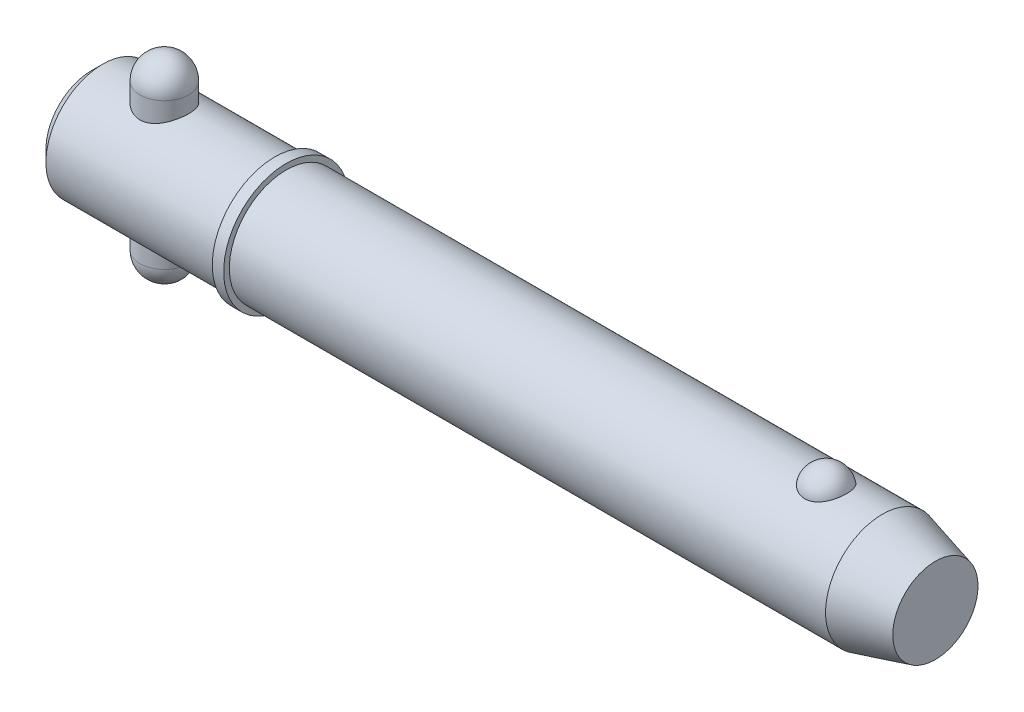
ISO-10303-21;
HEADER;
FILE_DESCRIPTION(('STEP AP214'),'2;1');
FILE_NAME('part.step','',(''),(''),'','','');
FILE_SCHEMA(('AUTOMOTIVE_DESIGN { 1 0 10303 214 1 1 1 1 }'));
ENDSEC;
DATA;
#1=APPLICATION_CONTEXT('core data for automotive mechanical design processes');
#2=APPLICATION_PROTOCOL_DEFINITION('international standard','automotive_design',2000,#1);
#3=PRODUCT_CONTEXT('',#1,'mechanical');
#4=PRODUCT('Part','Part','',(#3));
#5=PRODUCT_RELATED_PRODUCT_CATEGORY('part','',(#4));
#6=PRODUCT_DEFINITION_FORMATION('','',#4);
#7=PRODUCT_DEFINITION_CONTEXT('part definition',#1,'design');
#8=PRODUCT_DEFINITION('design','',#6,#7);
#9=PRODUCT_DEFINITION_SHAPE('','',#8);
#10=(LENGTH_UNIT() NAMED_UNIT(*) SI_UNIT(.MILLI.,.METRE.));
#11=(NAMED_UNIT(*) PLANE_ANGLE_UNIT() SI_UNIT($,.RADIAN.));
#12=(NAMED_UNIT(*) SI_UNIT($,.STERADIAN.) SOLID_ANGLE_UNIT());
#13=UNCERTAINTY_MEASURE_WITH_UNIT(LENGTH_MEASURE(1.E-05),#10,'distance_accuracy_value','');
#14=(GEOMETRIC_REPRESENTATION_CONTEXT(3) GLOBAL_UNCERTAINTY_ASSIGNED_CONTEXT((#13)) GLOBAL_UNIT_ASSIGNED_CONTEXT((#10,
#11,#12)) REPRESENTATION_CONTEXT('',''));
#15=CARTESIAN_POINT('',(0.,0.,0.));
#16=DIRECTION('',(0.,0.,1.));
#17=DIRECTION('',(1.,0.,0.));
#18=AXIS2_PLACEMENT_3D('',#15,#16,#17);
#19=CARTESIAN_POINT('',(14.28,19.05,0.));
#20=DIRECTION('',(0.,-1.,0.));
#21=DIRECTION('',(0.,0.,-1.));
#22=AXIS2_PLACEMENT_3D('',#19,#20,#21);
#23=CYLINDRICAL_SURFACE('',#22,4.76);
#24=CARTESIAN_POINT('',(14.28,-14.29,0.));
#25=DIRECTION('',(0.,-1.,0.));
#26=DIRECTION('',(0.,0.,-1.));
#27=AXIS2_PLACEMENT_3D('',#24,#25,#26);
#28=CIRCLE('',#27,4.76);
#29=CARTESIAN_POINT('',(14.28,-14.29,-4.76));
#30=VERTEX_POINT('',#29);
#31=EDGE_CURVE('P0_E10',#30,#30,#28,.F.);
#32=CARTESIAN_POINT('',(14.28,14.29,0.));
#33=DIRECTION('',(0.,-1.,0.));
#34=DIRECTION('',(0.,0.,-1.));
#35=AXIS2_PLACEMENT_3D('',#32,#33,#34);
#36=CIRCLE('',#35,4.76);
#37=CARTESIAN_POINT('',(14.28,14.29,-4.76));
#38=VERTEX_POINT('',#37);
#39=EDGE_CURVE('P0_E21',#38,#38,#36,.T.);
#40=CARTESIAN_POINT('',(14.28,-14.29,-4.76));
#41=CARTESIAN_POINT('',(14.28,-13.9922916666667,-4.76));
#42=CARTESIAN_POINT('',(14.28,-13.6945833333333,-4.76));
#43=CARTESIAN_POINT('',(14.28,-13.0991666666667,-4.76));
#44=CARTESIAN_POINT('',(14.28,-12.8014583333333,-4.76));
#45=CARTESIAN_POINT('',(14.28,-12.2060416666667,-4.76));
#46=CARTESIAN_POINT('',(14.28,-11.9083333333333,-4.76));
#47=CARTESIAN_POINT('',(14.28,-11.3129166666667,-4.76));
#48=CARTESIAN_POINT('',(14.28,-11.0152083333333,-4.76));
#49=CARTESIAN_POINT('',(14.28,-10.4197916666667,-4.76));
#50=CARTESIAN_POINT('',(14.28,-10.1220833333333,-4.76));
#51=CARTESIAN_POINT('',(14.28,-9.52666666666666,-4.76));
#52=CARTESIAN_POINT('',(14.28,-9.22895833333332,-4.76));
#53=CARTESIAN_POINT('',(14.28,-8.63354166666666,-4.76));
#54=CARTESIAN_POINT('',(14.28,-8.33583333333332,-4.76));
#55=CARTESIAN_POINT('',(14.28,-7.74041666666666,-4.76));
#56=CARTESIAN_POINT('',(14.28,-7.44270833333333,-4.76));
#57=CARTESIAN_POINT('',(14.28,-6.84729166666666,-4.76));
#58=CARTESIAN_POINT('',(14.28,-6.54958333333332,-4.76));
#59=CARTESIAN_POINT('',(14.28,-5.95416666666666,-4.76));
#60=CARTESIAN_POINT('',(14.28,-5.65645833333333,-4.76));
#61=CARTESIAN_POINT('',(14.28,-5.06104166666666,-4.76));
#62=CARTESIAN_POINT('',(14.28,-4.76333333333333,-4.76));
#63=CARTESIAN_POINT('',(14.28,-4.16791666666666,-4.76));
#64=CARTESIAN_POINT('',(14.28,-3.87020833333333,-4.76));
#65=CARTESIAN_POINT('',(14.28,-3.27479166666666,-4.76));
#66=CARTESIAN_POINT('',(14.28,-2.97708333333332,-4.76));
#67=CARTESIAN_POINT('',(14.28,-2.38166666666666,-4.76));
#68=CARTESIAN_POINT('',(14.28,-2.08395833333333,-4.76));
#69=CARTESIAN_POINT('',(14.28,-1.48854166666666,-4.76));
#70=CARTESIAN_POINT('',(14.28,-1.19083333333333,-4.76));
#71=CARTESIAN_POINT('',(14.28,-0.595416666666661,-4.76));
#72=CARTESIAN_POINT('',(14.28,-0.297708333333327,-4.76));
#73=CARTESIAN_POINT('',(14.28,0.297708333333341,-4.76));
#74=CARTESIAN_POINT('',(14.28,0.595416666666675,-4.76));
#75=CARTESIAN_POINT('',(14.28,1.19083333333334,-4.76));
#76=CARTESIAN_POINT('',(14.28,1.48854166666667,-4.76));
#77=CARTESIAN_POINT('',(14.28,2.08395833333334,-4.76));
#78=CARTESIAN_POINT('',(14.28,2.38166666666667,-4.76));
#79=CARTESIAN_POINT('',(14.28,2.97708333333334,-4.76));
#80=CARTESIAN_POINT('',(14.28,3.27479166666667,-4.76));
#81=CARTESIAN_POINT('',(14.28,3.87020833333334,-4.76));
#82=CARTESIAN_POINT('',(14.28,4.16791666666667,-4.76));
#83=CARTESIAN_POINT('',(14.28,4.76333333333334,-4.76));
#84=CARTESIAN_POINT('',(14.28,5.06104166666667,-4.76));
#85=CARTESIAN_POINT('',(14.28,5.65645833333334,-4.76));
#86=CARTESIAN_POINT('',(14.28,5.95416666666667,-4.76));
#87=CARTESIAN_POINT('',(14.28,6.54958333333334,-4.76));
#88=CARTESIAN_POINT('',(14.28,6.84729166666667,-4.76));
#89=CARTESIAN_POINT('',(14.28,7.44270833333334,-4.76));
#90=CARTESIAN_POINT('',(14.28,7.74041666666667,-4.76));
#91=CARTESIAN_POINT('',(14.28,8.33583333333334,-4.76));
#92=CARTESIAN_POINT('',(14.28,8.63354166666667,-4.76));
#93=CARTESIAN_POINT('',(14.28,9.22895833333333,-4.76));
#94=CARTESIAN_POINT('',(14.28,9.52666666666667,-4.76));
#95=CARTESIAN_POINT('',(14.28,10.1220833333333,-4.76));
#96=CARTESIAN_POINT('',(14.28,10.4197916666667,-4.76));
#97=CARTESIAN_POINT('',(14.28,11.0152083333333,-4.76));
#98=CARTESIAN_POINT('',(14.28,11.3129166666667,-4.76));
#99=CARTESIAN_POINT('',(14.28,11.9083333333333,-4.76));
#100=CARTESIAN_POINT('',(14.28,12.2060416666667,-4.76));
#101=CARTESIAN_POINT('',(14.28,12.8014583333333,-4.76));
#102=CARTESIAN_POINT('',(14.28,13.0991666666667,-4.76));
#103=CARTESIAN_POINT('',(14.28,13.6945833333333,-4.76));
#104=CARTESIAN_POINT('',(14.28,13.9922916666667,-4.76));
#105=CARTESIAN_POINT('',(14.28,14.29,-4.76));
#106=B_SPLINE_CURVE_WITH_KNOTS('',3,(#40,#41,#42,#43,#44,#45,#46,#47,#48,#49,#50,#51,#52,#53,
#54,#55,#56,#57,#58,#59,#60,#61,#62,#63,#64,#65,#66,#67,#68,#69,#70,#71,#72,#73,#74,#75,#76,#77,
#78,#79,#80,#81,#82,#83,#84,#85,#86,#87,#88,#89,#90,#91,#92,#93,#94,#95,#96,#97,#98,#99,#100,
#101,#102,#103,#104,#105),.UNSPECIFIED.,.F.,.F.,(4,2,2,2,2,2,2,2,2,2,2,2,2,2,2,2,2,2,2,2,2,2,2,
2,2,2,2,2,2,2,2,2,4),(0.,0.893125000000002,1.78625,2.67937499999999,3.5725,4.465625,5.35875,
6.25187499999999,7.145,8.038125,8.93125,9.82437499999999,10.7175,11.610625,12.50375,13.396875,
14.29,15.183125,16.07625,16.969375,17.8625,18.755625,19.64875,20.541875,21.435,22.328125,
23.22125,24.114375,25.0075,25.900625,26.79375,27.686875,28.58),.UNSPECIFIED.);
#107=EDGE_CURVE('P0_BSEAM14',#30,#38,#106,.T.);
#108=ORIENTED_EDGE('',*,*,#31,.T.);
#109=ORIENTED_EDGE('',*,*,#39,.T.);
#110=ORIENTED_EDGE('',*,*,#107,.T.);
#111=ORIENTED_EDGE('',*,*,#107,.F.);
#112=EDGE_LOOP('',(#108,#110,#109,#111));
#113=FACE_BOUND('',#112,.T.);
#114=ADVANCED_FACE('P0_F14',(#113),#23,.T.);
#115=CARTESIAN_POINT('',(14.28,-14.29,0.));
#116=DIRECTION('',(0.,0.,1.));
#117=DIRECTION('',(1.,0.,0.));
#118=AXIS2_PLACEMENT_3D('',#115,#116,#117);
#119=SPHERICAL_SURFACE('',#118,4.76);
#120=CARTESIAN_POINT('',(14.28,-14.29,0.));
#121=DIRECTION('',(0.,-1.,0.));
#122=DIRECTION('',(0.,0.,-1.));
#123=AXIS2_PLACEMENT_3D('',#120,#121,#122);
#124=SPHERICAL_SURFACE('',#123,4.76);
#125=ORIENTED_EDGE('',*,*,#31,.F.);
#126=EDGE_LOOP('',(#125));
#127=FACE_BOUND('',#126,.T.);
#128=ADVANCED_FACE('P0_F29',(#127),#124,.T.);
#129=CARTESIAN_POINT('',(14.28,14.29,0.));
#130=DIRECTION('',(0.,0.,1.));
#131=DIRECTION('',(1.,0.,0.));
#132=AXIS2_PLACEMENT_3D('',#129,#130,#131);
#133=SPHERICAL_SURFACE('',#132,4.76);
#134=CARTESIAN_POINT('',(14.28,14.29,0.));
#135=DIRECTION('',(0.,-1.,0.));
#136=DIRECTION('',(0.,0.,-1.));
#137=AXIS2_PLACEMENT_3D('',#134,#135,#136);
#138=SPHERICAL_SURFACE('',#137,4.76);
#139=ORIENTED_EDGE('',*,*,#39,.F.);
#140=EDGE_LOOP('',(#139));
#141=FACE_BOUND('',#140,.T.);
#142=ADVANCED_FACE('P0_F16',(#141),#138,.T.);
#143=CLOSED_SHELL('',(#114,#128,#142));
#144=MANIFOLD_SOLID_BREP('P0_B1',#143);
#145=CARTESIAN_POINT('',(0.,0.,0.));
#146=DIRECTION('',(1.,0.,0.));
#147=DIRECTION('',(0.,0.,-1.));
#148=AXIS2_PLACEMENT_3D('',#145,#146,#147);
#149=CYLINDRICAL_SURFACE('',#148,11.115);
#150=CARTESIAN_POINT('',(154.729563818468,0.,0.));
#151=DIRECTION('',(1.,0.,0.));
#152=DIRECTION('',(0.,0.,-1.));
#153=AXIS2_PLACEMENT_3D('',#150,#151,#152);
#154=CIRCLE('',#153,11.115);
#155=CARTESIAN_POINT('',(154.729563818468,0.,-11.115));
#156=VERTEX_POINT('',#155);
#157=EDGE_CURVE('P1_E81',#156,#156,#154,.T.);
#158=ORIENTED_EDGE('',*,*,#157,.F.);
#159=EDGE_LOOP('',(#158));
#160=FACE_BOUND('',#159,.T.);
#161=CARTESIAN_POINT('',(38.1,0.,0.));
#162=DIRECTION('',(1.,0.,0.));
#163=DIRECTION('',(0.,0.,-1.));
#164=AXIS2_PLACEMENT_3D('',#161,#162,#163);
#165=CIRCLE('',#164,11.115);
#166=CARTESIAN_POINT('',(38.1,0.,-11.115));
#167=VERTEX_POINT('',#166);
#168=EDGE_CURVE('P1_E85',#167,#167,#165,.T.);
#169=ORIENTED_EDGE('',*,*,#168,.T.);
#170=EDGE_LOOP('',(#169));
#171=FACE_BOUND('',#170,.T.);
#172=CARTESIAN_POINT('',(143.731068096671,10.3028087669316,4.17077409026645));
#173=CARTESIAN_POINT('',(143.514775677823,10.3028003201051,4.17078240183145));
#174=CARTESIAN_POINT('',(143.298548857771,10.3098895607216,4.15340593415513));
#175=CARTESIAN_POINT('',(142.872540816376,10.3373834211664,4.08449540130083));
#176=CARTESIAN_POINT('',(142.662757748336,10.3577841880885,4.0329712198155));
#177=CARTESIAN_POINT('',(142.255782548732,10.4095237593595,3.89746513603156));
#178=CARTESIAN_POINT('',(142.058572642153,10.4408466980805,3.81353029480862));
#179=CARTESIAN_POINT('',(141.681338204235,10.5110236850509,3.61560339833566));
#180=CARTESIAN_POINT('',(141.501317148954,10.5498792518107,3.50160528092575));
#181=CARTESIAN_POINT('',(141.157684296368,10.6322884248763,3.24292464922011));
#182=CARTESIAN_POINT('',(140.994686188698,10.6759443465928,3.09746040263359));
#183=CARTESIAN_POINT('',(140.694591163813,10.7625291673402,2.7817192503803));
#184=CARTESIAN_POINT('',(140.557499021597,10.8054579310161,2.61143778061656));
#185=CARTESIAN_POINT('',(140.306408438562,10.8881935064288,2.24226695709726));
#186=CARTESIAN_POINT('',(140.193710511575,10.9277761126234,2.04244123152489));
#187=CARTESIAN_POINT('',(140.001777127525,10.997484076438,1.62578254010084));
#188=CARTESIAN_POINT('',(139.922544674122,11.0276085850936,1.40894804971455));
#189=CARTESIAN_POINT('',(139.798303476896,11.0756732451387,0.961250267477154));
#190=CARTESIAN_POINT('',(139.753760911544,11.0934470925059,0.730239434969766));
#191=CARTESIAN_POINT('',(139.701569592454,11.1143331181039,0.263439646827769));
#192=CARTESIAN_POINT('',(139.693920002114,11.1174456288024,0.027650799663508));
#193=CARTESIAN_POINT('',(139.71561056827,11.1087161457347,-0.440729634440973));
#194=CARTESIAN_POINT('',(139.744762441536,11.0969502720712,-0.6733313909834));
#195=CARTESIAN_POINT('',(139.839143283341,11.0597872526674,-1.12996621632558));
#196=CARTESIAN_POINT('',(139.904372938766,11.0343898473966,-1.35399912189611));
#197=CARTESIAN_POINT('',(140.06969844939,10.972515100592,-1.78750286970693));
#198=CARTESIAN_POINT('',(140.16983863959,10.9360236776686,-1.99695478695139));
#199=CARTESIAN_POINT('',(140.402940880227,10.8557595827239,-2.3952066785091));
#200=CARTESIAN_POINT('',(140.535905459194,10.8119863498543,-2.5840050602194));
#201=CARTESIAN_POINT('',(140.832407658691,10.7216733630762,-2.93635726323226));
#202=CARTESIAN_POINT('',(140.996056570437,10.675123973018,-3.09981510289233));
#203=CARTESIAN_POINT('',(141.349860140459,10.5846571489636,-3.39592247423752));
#204=CARTESIAN_POINT('',(141.540012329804,10.5407394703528,-3.52857487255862));
#205=CARTESIAN_POINT('',(141.93750141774,10.4616690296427,-3.75646057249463));
#206=CARTESIAN_POINT('',(142.14436705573,10.4263443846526,-3.85245432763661));
#207=CARTESIAN_POINT('',(142.572954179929,10.3675574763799,-4.00798747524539));
#208=CARTESIAN_POINT('',(142.794670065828,10.344090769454,-4.0675405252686));
#209=CARTESIAN_POINT('',(143.234669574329,10.3128282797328,-4.14614314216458));
#210=CARTESIAN_POINT('',(143.452565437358,10.3043040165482,-4.1670783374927));
#211=CARTESIAN_POINT('',(143.88894951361,10.3016771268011,-4.17357158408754));
#212=CARTESIAN_POINT('',(144.107437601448,10.3075716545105,-4.15913661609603));
#213=CARTESIAN_POINT('',(144.531744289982,10.3326686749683,-4.09636961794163));
#214=CARTESIAN_POINT('',(144.737745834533,10.3514555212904,-4.0490957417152));
#215=CARTESIAN_POINT('',(145.138576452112,10.399818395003,-3.92320197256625));
#216=CARTESIAN_POINT('',(145.3334046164,10.4293952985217,-3.84457953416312));
#217=CARTESIAN_POINT('',(145.711191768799,10.4969600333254,-3.65612410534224));
#218=CARTESIAN_POINT('',(145.893797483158,10.5351178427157,-3.54564545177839));
#219=CARTESIAN_POINT('',(146.238204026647,10.6154999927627,-3.29718036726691));
#220=CARTESIAN_POINT('',(146.400000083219,10.657725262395,-3.15918764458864));
#221=CARTESIAN_POINT('',(146.706959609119,10.744212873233,-2.85163580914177));
#222=CARTESIAN_POINT('',(146.850891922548,10.7884718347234,-2.68084605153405));
#223=CARTESIAN_POINT('',(147.109237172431,10.872374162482,-2.31721864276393));
#224=CARTESIAN_POINT('',(147.223644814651,10.9120167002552,-2.12437704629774));
#225=CARTESIAN_POINT('',(147.423873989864,10.9838919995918,-1.71516999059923));
#226=CARTESIAN_POINT('',(147.50866178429,11.0158465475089,-1.49824866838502));
#227=CARTESIAN_POINT('',(147.64268382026,11.0673523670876,-1.05228572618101));
#228=CARTESIAN_POINT('',(147.691917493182,11.086903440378,-0.823243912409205));
#229=CARTESIAN_POINT('',(147.753891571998,11.1116323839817,-0.359087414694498));
#230=CARTESIAN_POINT('',(147.766566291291,11.1167843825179,-0.12396256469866));
#231=CARTESIAN_POINT('',(147.754973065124,11.1121144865,0.345220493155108));
#232=CARTESIAN_POINT('',(147.730705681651,11.1022928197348,0.579278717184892));
#233=CARTESIAN_POINT('',(147.645907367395,11.0687504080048,1.03866534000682));
#234=CARTESIAN_POINT('',(147.585529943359,11.0450885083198,1.26402641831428));
#235=CARTESIAN_POINT('',(147.429853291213,10.9863185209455,1.70076772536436));
#236=CARTESIAN_POINT('',(147.334551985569,10.9512097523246,1.91214712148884));
#237=CARTESIAN_POINT('',(147.110397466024,10.8729733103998,2.316083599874));
#238=CARTESIAN_POINT('',(146.981380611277,10.8298068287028,2.50854240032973));
#239=CARTESIAN_POINT('',(146.692732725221,10.7401896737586,2.86808766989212));
#240=CARTESIAN_POINT('',(146.533102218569,10.6937390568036,3.03517457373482));
#241=CARTESIAN_POINT('',(146.187534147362,10.6029321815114,3.33857581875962));
#242=CARTESIAN_POINT('',(146.001708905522,10.5585680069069,3.47501541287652));
#243=CARTESIAN_POINT('',(145.607875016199,10.4769321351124,3.71390897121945));
#244=CARTESIAN_POINT('',(145.399863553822,10.439661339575,3.81635861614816));
#245=CARTESIAN_POINT('',(144.954066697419,10.3749407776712,3.98910631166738));
#246=CARTESIAN_POINT('',(144.715234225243,10.3482457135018,4.05700929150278));
#247=CARTESIAN_POINT('',(144.227925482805,10.312188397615,4.14782844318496));
#248=CARTESIAN_POINT('',(143.979453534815,10.3028184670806,4.17076454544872));
#249=CARTESIAN_POINT('',(143.731068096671,10.3028087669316,4.17077409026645));
#250=B_SPLINE_CURVE_WITH_KNOTS('',3,(#172,#173,#174,#175,#176,#177,#178,#179,#180,#181,#182,
#183,#184,#185,#186,#187,#188,#189,#190,#191,#192,#193,#194,#195,#196,#197,#198,#199,#200,#201,
#202,#203,#204,#205,#206,#207,#208,#209,#210,#211,#212,#213,#214,#215,#216,#217,#218,#219,#220,
#221,#222,#223,#224,#225,#226,#227,#228,#229,#230,#231,#232,#233,#234,#235,#236,#237,#238,#239,
#240,#241,#242,#243,#244,#245,#246,#247,#248,#249),.UNSPECIFIED.,.T.,.F.,(4,2,2,2,2,2,2,2,2,2,2,
2,2,2,2,2,2,2,2,2,2,2,2,2,2,2,2,2,2,2,2,2,2,2,2,2,2,2,4),(0.,0.64796614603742,1.29574482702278,
1.9425864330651,2.58955857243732,3.25496465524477,3.92049326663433,4.61566368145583,
5.31089647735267,6.01531821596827,6.71972398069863,7.42054043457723,8.12137023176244,
8.82309331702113,9.5248704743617,10.2292439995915,10.9335519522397,11.6223330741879,
12.3108558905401,12.9647664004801,13.6185478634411,14.252184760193,14.8858731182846,
15.5334360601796,16.1811472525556,16.8611459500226,17.5412664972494,18.2431855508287,
18.9451158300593,19.6483065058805,20.3514864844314,21.0516982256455,21.7519516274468,
22.4556690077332,23.1593743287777,23.860149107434,24.5610129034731,25.3054529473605,
26.049562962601),.UNSPECIFIED.);
#251=CARTESIAN_POINT('',(143.731068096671,10.3028087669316,4.17077409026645));
#252=VERTEX_POINT('',#251);
#253=EDGE_CURVE('P1_E35',#252,#252,#250,.T.);
#254=ORIENTED_EDGE('',*,*,#253,.T.);
#255=EDGE_LOOP('',(#254));
#256=FACE_BOUND('',#255,.T.);
#257=ADVANCED_FACE('P1_F13',(#160,#171,#256),#149,.T.);
#258=CARTESIAN_POINT('',(0.,0.,0.));
#259=DIRECTION('',(-1.,0.,0.));
#260=DIRECTION('',(0.,0.,1.));
#261=AXIS2_PLACEMENT_3D('',#258,#259,#260);
#262=PLANE('',#261);
#263=CARTESIAN_POINT('',(0.,0.,0.));
#264=DIRECTION('',(1.,0.,0.));
#265=DIRECTION('',(0.,0.,-1.));
#266=AXIS2_PLACEMENT_3D('',#263,#264,#265);
#267=CIRCLE('',#266,8.892);
#268=CARTESIAN_POINT('',(0.,0.,-8.892));
#269=VERTEX_POINT('',#268);
#270=EDGE_CURVE('P1_E9',#269,#269,#267,.T.);
#271=ORIENTED_EDGE('',*,*,#270,.F.);
#272=EDGE_LOOP('',(#271));
#273=FACE_BOUND('',#272,.T.);
#274=ADVANCED_FACE('P1_F15',(#273),#262,.T.);
#275=CARTESIAN_POINT('',(2.22299999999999,0.,0.));
#276=DIRECTION('',(1.,0.,0.));
#277=DIRECTION('',(0.,0.,-1.));
#278=AXIS2_PLACEMENT_3D('',#275,#276,#277);
#279=CONICAL_SURFACE('',#278,11.115,0.78539816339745);
#280=ORIENTED_EDGE('',*,*,#270,.T.);
#281=EDGE_LOOP('',(#280));
#282=FACE_BOUND('',#281,.T.);
#283=CARTESIAN_POINT('',(2.22299999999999,0.,0.));
#284=DIRECTION('',(1.,0.,0.));
#285=DIRECTION('',(0.,0.,-1.));
#286=AXIS2_PLACEMENT_3D('',#283,#284,#285);
#287=CIRCLE('',#286,11.115);
#288=CARTESIAN_POINT('',(2.22299999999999,0.,-11.115));
#289=VERTEX_POINT('',#288);
#290=EDGE_CURVE('P1_E26',#289,#289,#287,.T.);
#291=ORIENTED_EDGE('',*,*,#290,.F.);
#292=EDGE_LOOP('',(#291));
#293=FACE_BOUND('',#292,.T.);
#294=ADVANCED_FACE('P1_F77',(#282,#293),#279,.T.);
#295=CARTESIAN_POINT('',(0.,0.,0.));
#296=DIRECTION('',(1.,0.,0.));
#297=DIRECTION('',(0.,0.,-1.));
#298=AXIS2_PLACEMENT_3D('',#295,#296,#297);
#299=CYLINDRICAL_SURFACE('',#298,11.115);
#300=CARTESIAN_POINT('',(14.28,-10.0441836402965,4.76));
#301=CARTESIAN_POINT('',(14.1533731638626,-10.0441846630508,4.75999904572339));
#302=CARTESIAN_POINT('',(14.0267055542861,-10.0465865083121,4.75493985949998));
#303=CARTESIAN_POINT('',(13.774298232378,-10.0561141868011,4.73475585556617));
#304=CARTESIAN_POINT('',(13.6485591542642,-10.0632429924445,4.71962470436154));
#305=CARTESIAN_POINT('',(13.3987500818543,-10.0819979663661,4.67942666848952));
#306=CARTESIAN_POINT('',(13.2746840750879,-10.0936334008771,4.65433930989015));
#307=CARTESIAN_POINT('',(13.0293244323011,-10.1210146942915,4.59449317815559));
#308=CARTESIAN_POINT('',(12.9080319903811,-10.1367622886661,4.55973032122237));
#309=CARTESIAN_POINT('',(12.669614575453,-10.1717810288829,4.48106435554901));
#310=CARTESIAN_POINT('',(12.5524727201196,-10.1910352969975,4.4372048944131));
#311=CARTESIAN_POINT('',(12.3224300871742,-10.2325403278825,4.34063417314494));
#312=CARTESIAN_POINT('',(12.2095309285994,-10.2547922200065,4.28791957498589));
#313=CARTESIAN_POINT('',(11.8782785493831,-10.3250879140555,4.11715127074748));
#314=CARTESIAN_POINT('',(11.6670799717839,-10.3767168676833,3.98637638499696));
#315=CARTESIAN_POINT('',(11.2564039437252,-10.4874309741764,3.68567149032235));
#316=CARTESIAN_POINT('',(11.0583793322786,-10.5467772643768,3.51386978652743));
#317=CARTESIAN_POINT('',(10.6927724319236,-10.6641377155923,3.13969960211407));
#318=CARTESIAN_POINT('',(10.5252022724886,-10.7221513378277,2.93731900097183));
#319=CARTESIAN_POINT('',(10.2965609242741,-10.8050020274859,2.60935726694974));
#320=CARTESIAN_POINT('',(10.2227768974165,-10.8324811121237,2.49310321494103));
#321=CARTESIAN_POINT('',(10.0853380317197,-10.884703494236,2.25418999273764));
#322=CARTESIAN_POINT('',(10.0216789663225,-10.9094479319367,2.13153352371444));
#323=CARTESIAN_POINT('',(9.90506238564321,-10.9554932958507,1.88060370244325));
#324=CARTESIAN_POINT('',(9.85210574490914,-10.9767939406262,1.7523298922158));
#325=CARTESIAN_POINT('',(9.75746464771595,-11.0153112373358,1.49115740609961));
#326=CARTESIAN_POINT('',(9.71577447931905,-11.0325299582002,1.35826111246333));
#327=CARTESIAN_POINT('',(9.64605475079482,-11.0615607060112,1.09614539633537));
#328=CARTESIAN_POINT('',(9.61740732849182,-11.0736151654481,0.96711700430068));
#329=CARTESIAN_POINT('',(9.57092026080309,-11.0932687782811,0.706847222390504));
#330=CARTESIAN_POINT('',(9.55307574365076,-11.1008699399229,0.575606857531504));
#331=CARTESIAN_POINT('',(9.52838640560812,-11.1114054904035,0.31192917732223));
#332=CARTESIAN_POINT('',(9.52153986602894,-11.114340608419,0.179492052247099));
#333=CARTESIAN_POINT('',(9.51892405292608,-11.1154607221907,-0.0855090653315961));
#334=CARTESIAN_POINT('',(9.52315432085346,-11.1136459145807,-0.218073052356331));
#335=CARTESIAN_POINT('',(9.542009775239,-11.1055891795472,-0.473709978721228));
#336=CARTESIAN_POINT('',(9.55594693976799,-11.099640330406,-0.596843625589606));
#337=CARTESIAN_POINT('',(9.59332832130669,-11.0837823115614,-0.841440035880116));
#338=CARTESIAN_POINT('',(9.61677567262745,-11.0738718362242,-0.962902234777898));
#339=CARTESIAN_POINT('',(9.67294089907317,-11.0503378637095,-1.20325684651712));
#340=CARTESIAN_POINT('',(9.70565569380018,-11.0367156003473,-1.32215009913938));
#341=CARTESIAN_POINT('',(9.78005008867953,-11.0060908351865,-1.55666640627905));
#342=CARTESIAN_POINT('',(9.82173311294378,-10.9890870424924,-1.67228819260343));
#343=CARTESIAN_POINT('',(9.96110379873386,-10.9330280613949,-2.01656166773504));
#344=CARTESIAN_POINT('',(10.0722987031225,-10.8892801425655,-2.23915547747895));
#345=CARTESIAN_POINT('',(10.3268588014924,-10.7934745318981,-2.66299199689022));
#346=CARTESIAN_POINT('',(10.4702355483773,-10.7414138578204,-2.86422700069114));
#347=CARTESIAN_POINT('',(10.7973904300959,-10.6296201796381,-3.25557775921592));
#348=CARTESIAN_POINT('',(10.9833705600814,-10.569604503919,-3.443774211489));
#349=CARTESIAN_POINT('',(11.3844486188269,-10.4514707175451,-3.78722133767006));
#350=CARTESIAN_POINT('',(11.5995590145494,-10.3933534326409,-3.94245783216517));
#351=CARTESIAN_POINT('',(11.9444340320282,-10.311516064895,-4.14990014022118));
#352=CARTESIAN_POINT('',(12.0654579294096,-10.2847012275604,-4.21573894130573));
#353=CARTESIAN_POINT('',(12.3132718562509,-10.2342051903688,-4.33688518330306));
#354=CARTESIAN_POINT('',(12.4400593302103,-10.2105226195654,-4.39219723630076));
#355=CARTESIAN_POINT('',(12.6985418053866,-10.1671237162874,-4.49174500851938));
#356=CARTESIAN_POINT('',(12.8302359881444,-10.1474067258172,-4.53598256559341));
#357=CARTESIAN_POINT('',(13.0975061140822,-10.1126841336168,-4.61287629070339));
#358=CARTESIAN_POINT('',(13.233079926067,-10.0976759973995,-4.64553869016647));
#359=CARTESIAN_POINT('',(13.4978553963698,-10.0737863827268,-4.6971059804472));
#360=CARTESIAN_POINT('',(13.6268754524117,-10.0645618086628,-4.716785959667));
#361=CARTESIAN_POINT('',(13.8862990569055,-10.051062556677,-4.74548419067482));
#362=CARTESIAN_POINT('',(14.0167019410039,-10.0467856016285,-4.75450734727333));
#363=CARTESIAN_POINT('',(14.277859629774,-10.0433352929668,-4.76179143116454));
#364=CARTESIAN_POINT('',(14.4086143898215,-10.0441613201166,-4.76005366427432));
#365=CARTESIAN_POINT('',(14.6694025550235,-10.0508838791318,-4.74584231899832));
#366=CARTESIAN_POINT('',(14.7994359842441,-10.0567802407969,-4.73336910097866));
#367=CARTESIAN_POINT('',(15.0487369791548,-10.0728449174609,-4.69907984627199));
#368=CARTESIAN_POINT('',(15.1681238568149,-10.0826872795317,-4.67797462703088));
#369=CARTESIAN_POINT('',(15.4045894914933,-10.1062580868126,-4.62682977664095));
#370=CARTESIAN_POINT('',(15.5216674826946,-10.1199877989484,-4.59678723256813));
#371=CARTESIAN_POINT('',(15.868278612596,-10.1664161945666,-4.49365911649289));
#372=CARTESIAN_POINT('',(16.0933756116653,-10.2043671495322,-4.40754694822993));
#373=CARTESIAN_POINT('',(16.5357981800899,-10.2919879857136,-4.19898201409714));
#374=CARTESIAN_POINT('',(16.7523611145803,-10.3420954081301,-4.07511281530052));
#375=CARTESIAN_POINT('',(17.1627188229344,-10.4477911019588,-3.7959429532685));
#376=CARTESIAN_POINT('',(17.3565033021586,-10.5033818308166,-3.64062816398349));
#377=CARTESIAN_POINT('',(17.7334034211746,-10.6196376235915,-3.28693729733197));
#378=CARTESIAN_POINT('',(17.9141276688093,-10.6803237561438,-3.08599175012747));
#379=CARTESIAN_POINT('',(18.1582189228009,-10.7666348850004,-2.76320365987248));
#380=CARTESIAN_POINT('',(18.2351223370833,-10.7946346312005,-2.65197124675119));
#381=CARTESIAN_POINT('',(18.3793967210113,-10.8483267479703,-2.42297927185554));
#382=CARTESIAN_POINT('',(18.4467718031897,-10.87402011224,-2.30522255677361));
#383=CARTESIAN_POINT('',(18.5717669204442,-10.9225249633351,-2.06324665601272));
#384=CARTESIAN_POINT('',(18.6293326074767,-10.9453202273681,-1.93899615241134));
#385=CARTESIAN_POINT('',(18.73370006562,-10.9872100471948,-1.6855059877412));
#386=CARTESIAN_POINT('',(18.7805065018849,-11.0063062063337,-1.55626851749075));
#387=CARTESIAN_POINT('',(18.8628731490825,-11.0402419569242,-1.29375150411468));
#388=CARTESIAN_POINT('',(18.8984366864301,-11.0550828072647,-1.16047316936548));
#389=CARTESIAN_POINT('',(18.9579183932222,-11.0800638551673,-0.890912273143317));
#390=CARTESIAN_POINT('',(18.9818374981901,-11.0902044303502,-0.75462995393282));
#391=CARTESIAN_POINT('',(19.0164177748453,-11.104911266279,-0.490295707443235));
#392=CARTESIAN_POINT('',(19.027922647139,-11.1098318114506,-0.362373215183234));
#393=CARTESIAN_POINT('',(19.040554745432,-11.1152360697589,-0.105876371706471));
#394=CARTESIAN_POINT('',(19.0416784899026,-11.1157182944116,0.0226981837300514));
#395=CARTESIAN_POINT('',(19.0335275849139,-11.1122291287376,0.27938352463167));
#396=CARTESIAN_POINT('',(19.0242587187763,-11.1082602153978,0.407494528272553));
#397=CARTESIAN_POINT('',(18.9954320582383,-11.0959792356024,0.662388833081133));
#398=CARTESIAN_POINT('',(18.9758704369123,-11.0876655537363,0.789171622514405));
#399=CARTESIAN_POINT('',(18.9276379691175,-11.0673259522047,1.03545890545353));
#400=CARTESIAN_POINT('',(18.8993573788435,-11.0554596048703,1.15505309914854));
#401=CARTESIAN_POINT('',(18.8337694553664,-11.0282166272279,1.39134516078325));
#402=CARTESIAN_POINT('',(18.7964589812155,-11.0128387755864,1.5080420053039));
#403=CARTESIAN_POINT('',(18.671464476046,-10.9619666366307,1.85262797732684));
#404=CARTESIAN_POINT('',(18.5706772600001,-10.9217161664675,2.07521484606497));
#405=CARTESIAN_POINT('',(18.33202463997,-10.8301378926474,2.51061719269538));
#406=CARTESIAN_POINT('',(18.1926775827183,-10.7783885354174,2.72252375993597));
#407=CARTESIAN_POINT('',(17.8829747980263,-10.669863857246,3.12088015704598));
#408=CARTESIAN_POINT('',(17.7126068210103,-10.6130865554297,3.30731987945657));
#409=CARTESIAN_POINT('',(17.3310036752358,-10.495668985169,3.66358491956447));
#410=CARTESIAN_POINT('',(17.1177010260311,-10.4350471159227,3.83122543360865));
#411=CARTESIAN_POINT('',(16.7778915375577,-10.3495418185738,4.05420569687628));
#412=CARTESIAN_POINT('',(16.6612023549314,-10.3219229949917,4.12383380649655));
#413=CARTESIAN_POINT('',(16.4218466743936,-10.2693487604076,4.25306463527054));
#414=CARTESIAN_POINT('',(16.2991829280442,-10.2443921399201,4.31267191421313));
#415=CARTESIAN_POINT('',(16.0488008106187,-10.1979981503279,4.42126071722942));
#416=CARTESIAN_POINT('',(15.9210894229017,-10.1765561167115,4.47025635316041));
#417=CARTESIAN_POINT('',(15.6613937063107,-10.1379191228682,4.55720152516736));
#418=CARTESIAN_POINT('',(15.5294115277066,-10.1207220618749,4.59515652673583));
#419=CARTESIAN_POINT('',(15.2624981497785,-10.091252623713,4.65951684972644));
#420=CARTESIAN_POINT('',(15.1275757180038,-10.0789672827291,4.68595259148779));
#421=CARTESIAN_POINT('',(14.8556442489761,-10.0597530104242,4.72706206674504));
#422=CARTESIAN_POINT('',(14.7186368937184,-10.0528199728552,4.74174481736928));
#423=CARTESIAN_POINT('',(14.5310955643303,-10.047196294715,4.75363843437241));
#424=CARTESIAN_POINT('',(14.48091543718,-10.0460674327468,4.75602323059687));
#425=CARTESIAN_POINT('',(14.3804923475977,-10.044560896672,4.7592042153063));
#426=CARTESIAN_POINT('',(14.3302493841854,-10.0441832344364,4.76000037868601));
#427=CARTESIAN_POINT('',(14.28,-10.0441836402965,4.76));
#428=B_SPLINE_CURVE_WITH_KNOTS('',3,(#300,#301,#302,#303,#304,#305,#306,#307,#308,#309,#310,
#311,#312,#313,#314,#315,#316,#317,#318,#319,#320,#321,#322,#323,#324,#325,#326,#327,#328,#329,
#330,#331,#332,#333,#334,#335,#336,#337,#338,#339,#340,#341,#342,#343,#344,#345,#346,#347,#348,
#349,#350,#351,#352,#353,#354,#355,#356,#357,#358,#359,#360,#361,#362,#363,#364,#365,#366,#367,
#368,#369,#370,#371,#372,#373,#374,#375,#376,#377,#378,#379,#380,#381,#382,#383,#384,#385,#386,
#387,#388,#389,#390,#391,#392,#393,#394,#395,#396,#397,#398,#399,#400,#401,#402,#403,#404,#405,
#406,#407,#408,#409,#410,#411,#412,#413,#414,#415,#416,#417,#418,#419,#420,#421,#422,#423,#424,
#425,#426,#427),.UNSPECIFIED.,.T.,.F.,(4,2,2,2,2,2,2,2,2,2,2,2,2,2,2,2,2,2,2,2,2,2,2,2,2,2,2,2,
2,2,2,2,2,2,2,2,2,2,2,2,2,2,2,2,2,2,2,2,2,2,2,2,2,2,2,2,2,2,2,2,2,2,2,4),(0.,0.379828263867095,
0.759895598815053,1.14074858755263,1.52176256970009,1.90098898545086,2.28035867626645,
3.03818035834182,3.84125131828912,4.6446414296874,5.06541657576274,5.48601561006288,
5.90664899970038,6.3270687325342,6.72470503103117,7.12216187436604,7.51955659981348,
7.91693487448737,8.28868404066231,8.66055582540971,9.03230414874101,9.40419465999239,
10.1585834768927,10.9132435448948,11.7236471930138,12.5343987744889,12.9550196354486,
13.3754557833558,13.7958221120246,14.2159617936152,14.6079540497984,14.9997658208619,
15.3915300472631,15.7832811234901,16.1477615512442,16.512360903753,17.240999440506,
18.0012974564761,18.761937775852,19.5886929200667,20.0025782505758,20.4162843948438,
20.832212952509,21.2479608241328,21.6635855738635,22.0791769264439,22.4642880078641,
22.8495282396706,23.2345541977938,23.6197234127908,23.9896813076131,24.3597680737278,
25.099327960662,25.8726239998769,26.6462260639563,27.4759193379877,27.8914891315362,
28.3068693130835,28.7216936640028,29.1363123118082,29.5498292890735,29.9630287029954,
30.113753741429,30.2644811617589),.UNSPECIFIED.);
#429=CARTESIAN_POINT('',(14.28,-10.0441836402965,4.76));
#430=VERTEX_POINT('',#429);
#431=EDGE_CURVE('P1_E17',#430,#430,#428,.T.);
#432=ORIENTED_EDGE('',*,*,#431,.F.);
#433=EDGE_LOOP('',(#432));
#434=FACE_BOUND('',#433,.T.);
#435=CARTESIAN_POINT('',(14.28,10.0441836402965,4.76));
#436=CARTESIAN_POINT('',(14.4066268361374,10.0441846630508,4.75999904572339));
#437=CARTESIAN_POINT('',(14.5332944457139,10.0465865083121,4.75493985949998));
#438=CARTESIAN_POINT('',(14.785701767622,10.0561141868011,4.73475585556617));
#439=CARTESIAN_POINT('',(14.9114408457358,10.0632429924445,4.71962470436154));
#440=CARTESIAN_POINT('',(15.1612499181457,10.0819979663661,4.67942666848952));
#441=CARTESIAN_POINT('',(15.2853159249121,10.0936334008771,4.65433930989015));
#442=CARTESIAN_POINT('',(15.5306755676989,10.1210146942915,4.59449317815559));
#443=CARTESIAN_POINT('',(15.6519680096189,10.1367622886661,4.55973032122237));
#444=CARTESIAN_POINT('',(15.890385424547,10.1717810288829,4.48106435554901));
#445=CARTESIAN_POINT('',(16.0075272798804,10.1910352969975,4.4372048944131));
#446=CARTESIAN_POINT('',(16.2375699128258,10.2325403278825,4.34063417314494));
#447=CARTESIAN_POINT('',(16.3504690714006,10.2547922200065,4.28791957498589));
#448=CARTESIAN_POINT('',(16.6817214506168,10.3250879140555,4.11715127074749));
#449=CARTESIAN_POINT('',(16.8929200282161,10.3767168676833,3.98637638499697));
#450=CARTESIAN_POINT('',(17.3035960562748,10.4874309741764,3.68567149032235));
#451=CARTESIAN_POINT('',(17.5016206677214,10.5467772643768,3.51386978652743));
#452=CARTESIAN_POINT('',(17.8672275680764,10.6641377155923,3.13969960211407));
#453=CARTESIAN_POINT('',(18.0347977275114,10.7221513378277,2.93731900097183));
#454=CARTESIAN_POINT('',(18.2634390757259,10.8050020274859,2.60935726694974));
#455=CARTESIAN_POINT('',(18.3372231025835,10.8324811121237,2.49310321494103));
#456=CARTESIAN_POINT('',(18.4746619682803,10.884703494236,2.25418999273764));
#457=CARTESIAN_POINT('',(18.5383210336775,10.9094479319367,2.13153352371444));
#458=CARTESIAN_POINT('',(18.6549376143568,10.9554932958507,1.88060370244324));
#459=CARTESIAN_POINT('',(18.7078942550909,10.9767939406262,1.75232989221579));
#460=CARTESIAN_POINT('',(18.8025353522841,11.0153112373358,1.4911574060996));
#461=CARTESIAN_POINT('',(18.844225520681,11.0325299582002,1.35826111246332));
#462=CARTESIAN_POINT('',(18.9139452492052,11.0615607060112,1.09614539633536));
#463=CARTESIAN_POINT('',(18.9425926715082,11.0736151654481,0.967117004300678));
#464=CARTESIAN_POINT('',(18.9890797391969,11.0932687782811,0.706847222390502));
#465=CARTESIAN_POINT('',(19.0069242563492,11.1008699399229,0.575606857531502));
#466=CARTESIAN_POINT('',(19.0316135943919,11.1114054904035,0.311929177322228));
#467=CARTESIAN_POINT('',(19.0384601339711,11.114340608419,0.179492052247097));
#468=CARTESIAN_POINT('',(19.0410759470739,11.1154607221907,-0.0855090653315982));
#469=CARTESIAN_POINT('',(19.0368456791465,11.1136459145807,-0.218073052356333));
#470=CARTESIAN_POINT('',(19.017990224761,11.1055891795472,-0.47370997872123));
#471=CARTESIAN_POINT('',(19.004053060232,11.099640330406,-0.596843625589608));
#472=CARTESIAN_POINT('',(18.9666716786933,11.0837823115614,-0.841440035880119));
#473=CARTESIAN_POINT('',(18.9432243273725,11.0738718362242,-0.9629022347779));
#474=CARTESIAN_POINT('',(18.8870591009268,11.0503378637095,-1.20325684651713));
#475=CARTESIAN_POINT('',(18.8543443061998,11.0367156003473,-1.32215009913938));
#476=CARTESIAN_POINT('',(18.7799499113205,11.0060908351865,-1.55666640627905));
#477=CARTESIAN_POINT('',(18.7382668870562,10.9890870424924,-1.67228819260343));
#478=CARTESIAN_POINT('',(18.5988962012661,10.9330280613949,-2.01656166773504));
#479=CARTESIAN_POINT('',(18.4877012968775,10.8892801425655,-2.23915547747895));
#480=CARTESIAN_POINT('',(18.2331411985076,10.7934745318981,-2.66299199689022));
#481=CARTESIAN_POINT('',(18.0897644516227,10.7414138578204,-2.86422700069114));
#482=CARTESIAN_POINT('',(17.7626095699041,10.6296201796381,-3.25557775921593));
#483=CARTESIAN_POINT('',(17.5766294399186,10.569604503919,-3.443774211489));
#484=CARTESIAN_POINT('',(17.1755513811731,10.4514707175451,-3.78722133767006));
#485=CARTESIAN_POINT('',(16.9604409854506,10.3933534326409,-3.94245783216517));
#486=CARTESIAN_POINT('',(16.6155659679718,10.311516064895,-4.14990014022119));
#487=CARTESIAN_POINT('',(16.4945420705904,10.2847012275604,-4.21573894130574));
#488=CARTESIAN_POINT('',(16.2467281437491,10.2342051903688,-4.33688518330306));
#489=CARTESIAN_POINT('',(16.1199406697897,10.2105226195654,-4.39219723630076));
#490=CARTESIAN_POINT('',(15.8614581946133,10.1671237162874,-4.49174500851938));
#491=CARTESIAN_POINT('',(15.7297640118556,10.1474067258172,-4.53598256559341));
#492=CARTESIAN_POINT('',(15.4624938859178,10.1126841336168,-4.61287629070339));
#493=CARTESIAN_POINT('',(15.326920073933,10.0976759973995,-4.64553869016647));
#494=CARTESIAN_POINT('',(15.0621446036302,10.0737863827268,-4.6971059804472));
#495=CARTESIAN_POINT('',(14.9331245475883,10.0645618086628,-4.716785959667));
#496=CARTESIAN_POINT('',(14.6737009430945,10.051062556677,-4.74548419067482));
#497=CARTESIAN_POINT('',(14.543298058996,10.0467856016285,-4.75450734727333));
#498=CARTESIAN_POINT('',(14.2821403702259,10.0433352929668,-4.76179143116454));
#499=CARTESIAN_POINT('',(14.1513856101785,10.0441613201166,-4.76005366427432));
#500=CARTESIAN_POINT('',(13.8905974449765,10.0508838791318,-4.74584231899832));
#501=CARTESIAN_POINT('',(13.7605640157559,10.0567802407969,-4.73336910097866));
#502=CARTESIAN_POINT('',(13.5112630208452,10.0728449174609,-4.69907984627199));
#503=CARTESIAN_POINT('',(13.3918761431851,10.0826872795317,-4.67797462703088));
#504=CARTESIAN_POINT('',(13.1554105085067,10.1062580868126,-4.62682977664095));
#505=CARTESIAN_POINT('',(13.0383325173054,10.1199877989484,-4.59678723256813));
#506=CARTESIAN_POINT('',(12.691721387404,10.1664161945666,-4.49365911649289));
#507=CARTESIAN_POINT('',(12.4666243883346,10.2043671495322,-4.40754694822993));
#508=CARTESIAN_POINT('',(12.0242018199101,10.2919879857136,-4.19898201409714));
#509=CARTESIAN_POINT('',(11.8076388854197,10.3420954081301,-4.07511281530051));
#510=CARTESIAN_POINT('',(11.3972811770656,10.4477911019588,-3.7959429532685));
#511=CARTESIAN_POINT('',(11.2034966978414,10.5033818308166,-3.64062816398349));
#512=CARTESIAN_POINT('',(10.8265965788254,10.6196376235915,-3.28693729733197));
#513=CARTESIAN_POINT('',(10.6458723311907,10.6803237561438,-3.08599175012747));
#514=CARTESIAN_POINT('',(10.4017810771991,10.7666348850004,-2.76320365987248));
#515=CARTESIAN_POINT('',(10.3248776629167,10.7946346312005,-2.65197124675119));
#516=CARTESIAN_POINT('',(10.1806032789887,10.8483267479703,-2.42297927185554));
#517=CARTESIAN_POINT('',(10.1132281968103,10.87402011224,-2.30522255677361));
#518=CARTESIAN_POINT('',(9.98823307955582,10.9225249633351,-2.06324665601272));
#519=CARTESIAN_POINT('',(9.93066739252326,10.9453202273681,-1.93899615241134));
#520=CARTESIAN_POINT('',(9.82629993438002,10.9872100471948,-1.6855059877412));
#521=CARTESIAN_POINT('',(9.77949349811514,11.0063062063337,-1.55626851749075));
#522=CARTESIAN_POINT('',(9.69712685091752,11.0402419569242,-1.29375150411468));
#523=CARTESIAN_POINT('',(9.66156331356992,11.0550828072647,-1.16047316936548));
#524=CARTESIAN_POINT('',(9.60208160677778,11.0800638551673,-0.890912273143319));
#525=CARTESIAN_POINT('',(9.57816250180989,11.0902044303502,-0.754629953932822));
#526=CARTESIAN_POINT('',(9.54358222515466,11.104911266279,-0.490295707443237));
#527=CARTESIAN_POINT('',(9.53207735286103,11.1098318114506,-0.362373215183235));
#528=CARTESIAN_POINT('',(9.51944525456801,11.1152360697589,-0.105876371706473));
#529=CARTESIAN_POINT('',(9.51832151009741,11.1157182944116,0.0226981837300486));
#530=CARTESIAN_POINT('',(9.52647241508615,11.1122291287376,0.279383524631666));
#531=CARTESIAN_POINT('',(9.53574128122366,11.1082602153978,0.407494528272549));
#532=CARTESIAN_POINT('',(9.5645679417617,11.0959792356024,0.662388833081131));
#533=CARTESIAN_POINT('',(9.58412956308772,11.0876655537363,0.789171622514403));
#534=CARTESIAN_POINT('',(9.63236203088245,11.0673259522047,1.03545890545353));
#535=CARTESIAN_POINT('',(9.66064262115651,11.0554596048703,1.15505309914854));
#536=CARTESIAN_POINT('',(9.72623054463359,11.0282166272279,1.39134516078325));
#537=CARTESIAN_POINT('',(9.76354101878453,11.0128387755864,1.5080420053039));
#538=CARTESIAN_POINT('',(9.88853552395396,10.9619666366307,1.85262797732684));
#539=CARTESIAN_POINT('',(9.98932273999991,10.9217161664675,2.07521484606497));
#540=CARTESIAN_POINT('',(10.22797536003,10.8301378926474,2.51061719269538));
#541=CARTESIAN_POINT('',(10.3673224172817,10.7783885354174,2.72252375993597));
#542=CARTESIAN_POINT('',(10.6770252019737,10.669863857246,3.12088015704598));
#543=CARTESIAN_POINT('',(10.8473931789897,10.6130865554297,3.30731987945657));
#544=CARTESIAN_POINT('',(11.2289963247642,10.495668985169,3.66358491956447));
#545=CARTESIAN_POINT('',(11.4422989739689,10.4350471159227,3.83122543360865));
#546=CARTESIAN_POINT('',(11.7821084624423,10.3495418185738,4.05420569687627));
#547=CARTESIAN_POINT('',(11.8987976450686,10.3219229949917,4.12383380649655));
#548=CARTESIAN_POINT('',(12.1381533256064,10.2693487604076,4.25306463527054));
#549=CARTESIAN_POINT('',(12.2608170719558,10.2443921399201,4.31267191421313));
#550=CARTESIAN_POINT('',(12.5111991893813,10.1979981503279,4.42126071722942));
#551=CARTESIAN_POINT('',(12.6389105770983,10.1765561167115,4.47025635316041));
#552=CARTESIAN_POINT('',(12.8986062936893,10.1379191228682,4.55720152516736));
#553=CARTESIAN_POINT('',(13.0305884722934,10.1207220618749,4.59515652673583));
#554=CARTESIAN_POINT('',(13.2975018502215,10.091252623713,4.65951684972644));
#555=CARTESIAN_POINT('',(13.4324242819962,10.0789672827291,4.68595259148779));
#556=CARTESIAN_POINT('',(13.7043557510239,10.0597530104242,4.72706206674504));
#557=CARTESIAN_POINT('',(13.8413631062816,10.0528199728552,4.74174481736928));
#558=CARTESIAN_POINT('',(14.0289044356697,10.047196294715,4.75363843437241));
#559=CARTESIAN_POINT('',(14.07908456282,10.0460674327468,4.75602323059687));
#560=CARTESIAN_POINT('',(14.1795076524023,10.044560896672,4.7592042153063));
#561=CARTESIAN_POINT('',(14.2297506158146,10.0441832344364,4.76000037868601));
#562=CARTESIAN_POINT('',(14.28,10.0441836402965,4.76));
#563=B_SPLINE_CURVE_WITH_KNOTS('',3,(#435,#436,#437,#438,#439,#440,#441,#442,#443,#444,#445,
#446,#447,#448,#449,#450,#451,#452,#453,#454,#455,#456,#457,#458,#459,#460,#461,#462,#463,#464,
#465,#466,#467,#468,#469,#470,#471,#472,#473,#474,#475,#476,#477,#478,#479,#480,#481,#482,#483,
#484,#485,#486,#487,#488,#489,#490,#491,#492,#493,#494,#495,#496,#497,#498,#499,#500,#501,#502,
#503,#504,#505,#506,#507,#508,#509,#510,#511,#512,#513,#514,#515,#516,#517,#518,#519,#520,#521,
#522,#523,#524,#525,#526,#527,#528,#529,#530,#531,#532,#533,#534,#535,#536,#537,#538,#539,#540,
#541,#542,#543,#544,#545,#546,#547,#548,#549,#550,#551,#552,#553,#554,#555,#556,#557,#558,#559,
#560,#561,#562),.UNSPECIFIED.,.T.,.F.,(4,2,2,2,2,2,2,2,2,2,2,2,2,2,2,2,2,2,2,2,2,2,2,2,2,2,2,2,
2,2,2,2,2,2,2,2,2,2,2,2,2,2,2,2,2,2,2,2,2,2,2,2,2,2,2,2,2,2,2,2,2,2,2,4),(0.,0.379828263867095,
0.759895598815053,1.14074858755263,1.52176256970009,1.90098898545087,2.28035867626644,
3.03818035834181,3.84125131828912,4.6446414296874,5.06541657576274,5.48601561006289,
5.90664899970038,6.3270687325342,6.72470503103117,7.12216187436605,7.51955659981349,
7.91693487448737,8.28868404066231,8.66055582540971,9.03230414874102,9.4041946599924,
10.1585834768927,10.9132435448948,11.7236471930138,12.5343987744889,12.9550196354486,
13.3754557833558,13.7958221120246,14.2159617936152,14.6079540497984,14.9997658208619,
15.3915300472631,15.7832811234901,16.1477615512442,16.512360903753,17.240999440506,
18.0012974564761,18.761937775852,19.5886929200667,20.0025782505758,20.4162843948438,
20.832212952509,21.2479608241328,21.6635855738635,22.0791769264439,22.4642880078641,
22.8495282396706,23.2345541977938,23.6197234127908,23.9896813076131,24.3597680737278,
25.099327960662,25.8726239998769,26.6462260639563,27.4759193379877,27.8914891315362,
28.3068693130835,28.7216936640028,29.1363123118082,29.5498292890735,29.9630287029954,
30.113753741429,30.2644811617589),.UNSPECIFIED.);
#564=CARTESIAN_POINT('',(14.28,10.0441836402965,4.76));
#565=VERTEX_POINT('',#564);
#566=EDGE_CURVE('P1_E43',#565,#565,#563,.T.);
#567=ORIENTED_EDGE('',*,*,#566,.F.);
#568=EDGE_LOOP('',(#567));
#569=FACE_BOUND('',#568,.T.);
#570=ORIENTED_EDGE('',*,*,#290,.T.);
#571=EDGE_LOOP('',(#570));
#572=FACE_BOUND('',#571,.T.);
#573=CARTESIAN_POINT('',(35.877,0.,0.));
#574=DIRECTION('',(1.,0.,0.));
#575=DIRECTION('',(0.,0.,-1.));
#576=AXIS2_PLACEMENT_3D('',#573,#574,#575);
#577=CIRCLE('',#576,11.115);
#578=CARTESIAN_POINT('',(35.877,0.,-11.115));
#579=VERTEX_POINT('',#578);
#580=EDGE_CURVE('P1_E31',#579,#579,#577,.T.);
#581=ORIENTED_EDGE('',*,*,#580,.F.);
#582=EDGE_LOOP('',(#581));
#583=FACE_BOUND('',#582,.T.);
#584=ADVANCED_FACE('P1_F103',(#434,#569,#572,#583),#299,.T.);
#585=CARTESIAN_POINT('',(35.877,11.115,0.));
#586=DIRECTION('',(-1.,0.,0.));
#587=DIRECTION('',(0.,0.,1.));
#588=AXIS2_PLACEMENT_3D('',#585,#586,#587);
#589=PLANE('',#588);
#590=ORIENTED_EDGE('',*,*,#580,.T.);
#591=EDGE_LOOP('',(#590));
#592=FACE_BOUND('',#591,.T.);
#593=CARTESIAN_POINT('',(35.877,0.,0.));
#594=DIRECTION('',(1.,0.,0.));
#595=DIRECTION('',(0.,0.,-1.));
#596=AXIS2_PLACEMENT_3D('',#593,#594,#595);
#597=CIRCLE('',#596,12.2265);
#598=CARTESIAN_POINT('',(35.877,0.,-12.2265));
#599=VERTEX_POINT('',#598);
#600=EDGE_CURVE('P1_E91',#599,#599,#597,.T.);
#601=ORIENTED_EDGE('',*,*,#600,.F.);
#602=EDGE_LOOP('',(#601));
#603=FACE_BOUND('',#602,.T.);
#604=ADVANCED_FACE('P1_F100',(#592,#603),#589,.T.);
#605=CARTESIAN_POINT('',(0.,0.,0.));
#606=DIRECTION('',(1.,0.,0.));
#607=DIRECTION('',(0.,0.,-1.));
#608=AXIS2_PLACEMENT_3D('',#605,#606,#607);
#609=CYLINDRICAL_SURFACE('',#608,12.2265);
#610=ORIENTED_EDGE('',*,*,#600,.T.);
#611=EDGE_LOOP('',(#610));
#612=FACE_BOUND('',#611,.T.);
#613=CARTESIAN_POINT('',(38.1,0.,0.));
#614=DIRECTION('',(1.,0.,0.));
#615=DIRECTION('',(0.,0.,-1.));
#616=AXIS2_PLACEMENT_3D('',#613,#614,#615);
#617=CIRCLE('',#616,12.2265);
#618=CARTESIAN_POINT('',(38.1,0.,-12.2265));
#619=VERTEX_POINT('',#618);
#620=EDGE_CURVE('P1_E88',#619,#619,#617,.T.);
#621=ORIENTED_EDGE('',*,*,#620,.F.);
#622=EDGE_LOOP('',(#621));
#623=FACE_BOUND('',#622,.T.);
#624=ADVANCED_FACE('P1_F68',(#612,#623),#609,.T.);
#625=CARTESIAN_POINT('',(38.1,12.2265,0.));
#626=DIRECTION('',(1.,0.,0.));
#627=DIRECTION('',(0.,0.,-1.));
#628=AXIS2_PLACEMENT_3D('',#625,#626,#627);
#629=PLANE('',#628);
#630=ORIENTED_EDGE('',*,*,#620,.T.);
#631=EDGE_LOOP('',(#630));
#632=FACE_BOUND('',#631,.T.);
#633=ORIENTED_EDGE('',*,*,#168,.F.);
#634=EDGE_LOOP('',(#633));
#635=FACE_BOUND('',#634,.T.);
#636=ADVANCED_FACE('P1_F62',(#632,#635),#629,.T.);
#637=CARTESIAN_POINT('',(165.1,0.,0.));
#638=DIRECTION('',(-1.,0.,0.));
#639=DIRECTION('',(0.,0.,1.));
#640=AXIS2_PLACEMENT_3D('',#637,#638,#639);
#641=CONICAL_SURFACE('',#640,8.33625000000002,0.26179938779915);
#642=ORIENTED_EDGE('',*,*,#157,.T.);
#643=EDGE_LOOP('',(#642));
#644=FACE_BOUND('',#643,.T.);
#645=CARTESIAN_POINT('',(165.1,0.,0.));
#646=DIRECTION('',(1.,0.,0.));
#647=DIRECTION('',(0.,0.,-1.));
#648=AXIS2_PLACEMENT_3D('',#645,#646,#647);
#649=CIRCLE('',#648,8.33625000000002);
#650=CARTESIAN_POINT('',(165.1,0.,-8.33625000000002));
#651=VERTEX_POINT('',#650);
#652=EDGE_CURVE('P1_E42',#651,#651,#649,.T.);
#653=ORIENTED_EDGE('',*,*,#652,.F.);
#654=EDGE_LOOP('',(#653));
#655=FACE_BOUND('',#654,.T.);
#656=ADVANCED_FACE('P1_F59',(#644,#655),#641,.T.);
#657=CARTESIAN_POINT('',(165.1,8.33625000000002,0.));
#658=DIRECTION('',(1.,0.,0.));
#659=DIRECTION('',(0.,0.,-1.));
#660=AXIS2_PLACEMENT_3D('',#657,#658,#659);
#661=PLANE('',#660);
#662=ORIENTED_EDGE('',*,*,#652,.T.);
#663=EDGE_LOOP('',(#662));
#664=FACE_BOUND('',#663,.T.);
#665=ADVANCED_FACE('P1_F55',(#664),#661,.T.);
#666=CARTESIAN_POINT('',(143.731068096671,10.0035,0.));
#667=DIRECTION('',(-1.,0.,0.));
#668=DIRECTION('',(0.,1.,0.));
#669=AXIS2_PLACEMENT_3D('',#666,#667,#668);
#670=SPHERICAL_SURFACE('',#669,4.18150000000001);
#671=ORIENTED_EDGE('',*,*,#253,.F.);
#672=EDGE_LOOP('',(#671));
#673=FACE_BOUND('',#672,.T.);
#674=ADVANCED_FACE('P1_F50',(#673),#670,.T.);
#675=CARTESIAN_POINT('',(14.28,-12.2265,0.));
#676=DIRECTION('',(0.,1.,0.));
#677=DIRECTION('',(0.,0.,1.));
#678=AXIS2_PLACEMENT_3D('',#675,#676,#677);
#679=CYLINDRICAL_SURFACE('',#678,4.76);
#680=ORIENTED_EDGE('',*,*,#431,.T.);
#681=EDGE_LOOP('',(#680));
#682=FACE_BOUND('',#681,.T.);
#683=ORIENTED_EDGE('',*,*,#566,.T.);
#684=EDGE_LOOP('',(#683));
#685=FACE_BOUND('',#684,.T.);
#686=ADVANCED_FACE('P1_F54',(#682,#685),#679,.F.);
#687=CLOSED_SHELL('',(#257,#274,#294,#584,#604,#624,#636,#656,#665,#674,#686));
#688=MANIFOLD_SOLID_BREP('P1_B1',#687);
#689=ADVANCED_BREP_SHAPE_REPRESENTATION('',(#18,#144,#688),#14);
#690=SHAPE_DEFINITION_REPRESENTATION(#9,#689);
ENDSEC;
END-ISO-10303-21;
